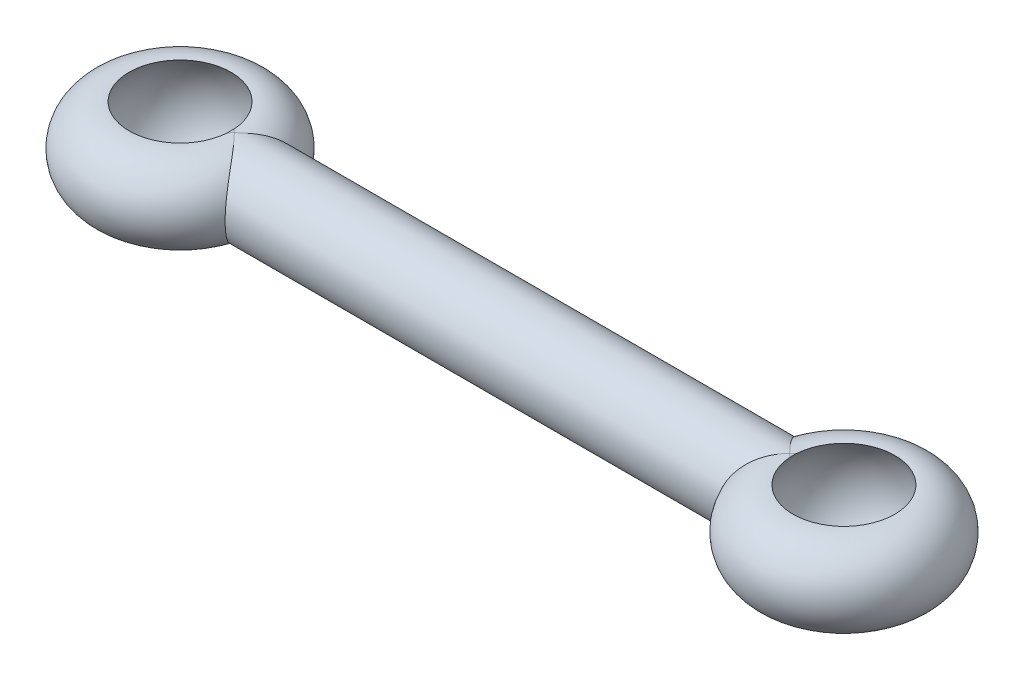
ISO-10303-21;
HEADER;
FILE_DESCRIPTION(('STEP AP214'),'2;1');
FILE_NAME('part.step','',(''),(''),'','','');
FILE_SCHEMA(('AUTOMOTIVE_DESIGN { 1 0 10303 214 1 1 1 1 }'));
ENDSEC;
DATA;
#1=APPLICATION_CONTEXT('core data for automotive mechanical design processes');
#2=APPLICATION_PROTOCOL_DEFINITION('international standard','automotive_design',2000,#1);
#3=PRODUCT_CONTEXT('',#1,'mechanical');
#4=PRODUCT('Part','Part','',(#3));
#5=PRODUCT_RELATED_PRODUCT_CATEGORY('part','',(#4));
#6=PRODUCT_DEFINITION_FORMATION('','',#4);
#7=PRODUCT_DEFINITION_CONTEXT('part definition',#1,'design');
#8=PRODUCT_DEFINITION('design','',#6,#7);
#9=PRODUCT_DEFINITION_SHAPE('','',#8);
#10=(LENGTH_UNIT() NAMED_UNIT(*) SI_UNIT(.MILLI.,.METRE.));
#11=(NAMED_UNIT(*) PLANE_ANGLE_UNIT() SI_UNIT($,.RADIAN.));
#12=(NAMED_UNIT(*) SI_UNIT($,.STERADIAN.) SOLID_ANGLE_UNIT());
#13=UNCERTAINTY_MEASURE_WITH_UNIT(LENGTH_MEASURE(1.E-05),#10,'distance_accuracy_value','');
#14=(GEOMETRIC_REPRESENTATION_CONTEXT(3) GLOBAL_UNCERTAINTY_ASSIGNED_CONTEXT((#13)) GLOBAL_UNIT_ASSIGNED_CONTEXT((#10,
#11,#12)) REPRESENTATION_CONTEXT('',''));
#15=CARTESIAN_POINT('',(0.,0.,0.));
#16=DIRECTION('',(0.,0.,1.));
#17=DIRECTION('',(1.,0.,0.));
#18=AXIS2_PLACEMENT_3D('',#15,#16,#17);
#19=CARTESIAN_POINT('',(0.,0.,0.));
#20=DIRECTION('',(-1.,0.,0.));
#21=DIRECTION('',(0.,0.,1.));
#22=AXIS2_PLACEMENT_3D('',#19,#20,#21);
#23=CYLINDRICAL_SURFACE('',#22,0.749999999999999);
#24=CARTESIAN_POINT('',(1.,0.750000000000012,0.));
#25=CARTESIAN_POINT('',(1.0012909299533,0.750000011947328,-0.00129092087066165));
#26=CARTESIAN_POINT('',(1.00258067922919,0.749996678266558,-0.00258317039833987));
#27=CARTESIAN_POINT('',(1.05229490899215,0.749738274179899,-0.0524900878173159));
#28=CARTESIAN_POINT('',(1.09904283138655,0.744735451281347,-0.102948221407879));
#29=CARTESIAN_POINT('',(1.18846651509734,0.723266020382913,-0.205226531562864));
#30=CARTESIAN_POINT('',(1.2311375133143,0.706786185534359,-0.257048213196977));
#31=CARTESIAN_POINT('',(1.30014078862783,0.667282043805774,-0.344763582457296));
#32=CARTESIAN_POINT('',(1.32771424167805,0.647357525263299,-0.38107468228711));
#33=CARTESIAN_POINT('',(1.37964821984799,0.600449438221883,-0.451378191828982));
#34=CARTESIAN_POINT('',(1.40401139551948,0.573471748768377,-0.485372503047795));
#35=CARTESIAN_POINT('',(1.44910416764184,0.512178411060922,-0.549694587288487));
#36=CARTESIAN_POINT('',(1.46979868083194,0.477798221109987,-0.57998617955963));
#37=CARTESIAN_POINT('',(1.50650588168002,0.402402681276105,-0.634611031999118));
#38=CARTESIAN_POINT('',(1.52252303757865,0.361393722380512,-0.658949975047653));
#39=CARTESIAN_POINT('',(1.54713224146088,0.280589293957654,-0.696744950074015));
#40=CARTESIAN_POINT('',(1.55647639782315,0.241529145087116,-0.711284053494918));
#41=CARTESIAN_POINT('',(1.57084552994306,0.160804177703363,-0.733751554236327));
#42=CARTESIAN_POINT('',(1.57587476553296,0.119141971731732,-0.741686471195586));
#43=CARTESIAN_POINT('',(1.58103957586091,0.0401544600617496,-0.749840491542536));
#44=CARTESIAN_POINT('',(1.58171498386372,0.00294939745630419,-0.750910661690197));
#45=CARTESIAN_POINT('',(1.57958279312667,-0.0711027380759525,-0.747540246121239));
#46=CARTESIAN_POINT('',(1.57677627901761,-0.107949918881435,-0.743101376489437));
#47=CARTESIAN_POINT('',(1.56794662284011,-0.178884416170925,-0.72921914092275));
#48=CARTESIAN_POINT('',(1.56204231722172,-0.213023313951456,-0.719960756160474));
#49=CARTESIAN_POINT('',(1.54728280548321,-0.279094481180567,-0.697014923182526));
#50=CARTESIAN_POINT('',(1.5384272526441,-0.311026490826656,-0.683326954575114));
#51=CARTESIAN_POINT('',(1.51752567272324,-0.373478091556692,-0.651385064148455));
#52=CARTESIAN_POINT('',(1.50534735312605,-0.403857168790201,-0.632944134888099));
#53=CARTESIAN_POINT('',(1.47834522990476,-0.460950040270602,-0.592661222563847));
#54=CARTESIAN_POINT('',(1.4635205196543,-0.487662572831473,-0.570818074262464));
#55=CARTESIAN_POINT('',(1.42972459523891,-0.539949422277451,-0.521897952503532));
#56=CARTESIAN_POINT('',(1.41047357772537,-0.565049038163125,-0.494508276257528));
#57=CARTESIAN_POINT('',(1.36949326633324,-0.610227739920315,-0.437545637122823));
#58=CARTESIAN_POINT('',(1.34776258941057,-0.630304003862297,-0.407971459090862));
#59=CARTESIAN_POINT('',(1.29842129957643,-0.668418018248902,-0.342597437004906));
#60=CARTESIAN_POINT('',(1.27043125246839,-0.685578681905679,-0.306573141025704));
#61=CARTESIAN_POINT('',(1.21204023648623,-0.713592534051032,-0.234093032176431));
#62=CARTESIAN_POINT('',(1.18163865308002,-0.724444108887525,-0.197637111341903));
#63=CARTESIAN_POINT('',(1.10356801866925,-0.744225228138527,-0.107849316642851));
#64=CARTESIAN_POINT('',(1.05462117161,-0.749725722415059,-0.0548256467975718));
#65=CARTESIAN_POINT('',(1.00258065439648,-0.749996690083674,-0.00258313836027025));
#66=CARTESIAN_POINT('',(1.0012909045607,-0.75000002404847,-0.00129088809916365));
#67=CARTESIAN_POINT('',(1.,-0.750000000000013,0.));
#68=B_SPLINE_CURVE_WITH_KNOTS('',3,(#24,#25,#26,#27,#28,#29,#30,#31,#32,#33,#34,#35,#36,#37,#38,
#39,#40,#41,#42,#43,#44,#45,#46,#47,#48,#49,#50,#51,#52,#53,#54,#55,#56,#57,#58,#59,#60,#61,#62,
#63,#64,#65,#66,#67),.UNSPECIFIED.,.F.,.F.,(4,2,2,2,2,2,2,2,2,2,2,2,2,2,2,2,2,2,2,2,2,4),(0.,
0.00547723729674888,0.211318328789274,0.417397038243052,0.566096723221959,0.714672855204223,
0.864601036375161,1.014385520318,1.14177482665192,1.2690382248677,1.38015835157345,
1.49124387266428,1.59834979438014,1.70546830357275,1.81770805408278,1.92998633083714,
2.05502993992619,2.18014363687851,2.32581656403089,2.47152673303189,2.68725182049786,
2.69272905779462),.UNSPECIFIED.);
#69=CARTESIAN_POINT('',(1.,0.750000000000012,0.));
#70=VERTEX_POINT('',#69);
#71=CARTESIAN_POINT('',(1.,-0.750000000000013,0.));
#72=VERTEX_POINT('',#71);
#73=EDGE_CURVE('E180',#70,#72,#68,.T.);
#74=ORIENTED_EDGE('',*,*,#73,.F.);
#75=CARTESIAN_POINT('',(1.,-0.750000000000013,0.));
#76=CARTESIAN_POINT('',(1.00129092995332,-0.750000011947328,0.00129092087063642));
#77=CARTESIAN_POINT('',(1.00258067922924,-0.749996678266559,0.00258317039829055));
#78=CARTESIAN_POINT('',(1.05229490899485,-0.749738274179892,0.0524900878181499));
#79=CARTESIAN_POINT('',(1.0990428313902,-0.744735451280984,0.102948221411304));
#80=CARTESIAN_POINT('',(1.18846651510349,-0.723266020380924,0.205226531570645));
#81=CARTESIAN_POINT('',(1.23113751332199,-0.706786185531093,0.257048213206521));
#82=CARTESIAN_POINT('',(1.30014078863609,-0.667282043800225,0.344763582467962));
#83=CARTESIAN_POINT('',(1.32771424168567,-0.647357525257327,0.381074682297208));
#84=CARTESIAN_POINT('',(1.37964821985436,-0.60044943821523,0.451378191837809));
#85=CARTESIAN_POINT('',(1.40401139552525,-0.573471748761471,0.48537250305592));
#86=CARTESIAN_POINT('',(1.44910416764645,-0.512178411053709,0.549694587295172));
#87=CARTESIAN_POINT('',(1.46979868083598,-0.47779822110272,0.579986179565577));
#88=CARTESIAN_POINT('',(1.506505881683,-0.402402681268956,0.634611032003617));
#89=CARTESIAN_POINT('',(1.52252303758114,-0.361393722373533,0.658949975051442));
#90=CARTESIAN_POINT('',(1.54713224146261,-0.280589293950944,0.696744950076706));
#91=CARTESIAN_POINT('',(1.55647639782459,-0.24152914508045,0.711284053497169));
#92=CARTESIAN_POINT('',(1.57084552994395,-0.160804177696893,0.733751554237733));
#93=CARTESIAN_POINT('',(1.57587476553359,-0.119141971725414,0.741686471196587));
#94=CARTESIAN_POINT('',(1.58103957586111,-0.040154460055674,0.749840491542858));
#95=CARTESIAN_POINT('',(1.58171498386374,-0.00294939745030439,0.750910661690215));
#96=CARTESIAN_POINT('',(1.57958279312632,0.0711027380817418,0.747540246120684));
#97=CARTESIAN_POINT('',(1.57677627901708,0.10794991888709,0.74310137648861));
#98=CARTESIAN_POINT('',(1.56794662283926,0.178884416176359,0.729219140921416));
#99=CARTESIAN_POINT('',(1.56204231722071,0.213023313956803,0.71996075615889));
#100=CARTESIAN_POINT('',(1.54728280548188,0.279094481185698,0.69701492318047));
#101=CARTESIAN_POINT('',(1.53842725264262,0.311026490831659,0.683326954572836));
#102=CARTESIAN_POINT('',(1.51752567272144,0.37347809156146,0.651385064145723));
#103=CARTESIAN_POINT('',(1.50534735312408,0.403857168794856,0.632944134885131));
#104=CARTESIAN_POINT('',(1.47834522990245,0.460950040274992,0.592661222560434));
#105=CARTESIAN_POINT('',(1.46352051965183,0.487662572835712,0.570818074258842));
#106=CARTESIAN_POINT('',(1.42972459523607,0.539949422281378,0.521897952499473));
#107=CARTESIAN_POINT('',(1.41047357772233,0.565049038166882,0.49450827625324));
#108=CARTESIAN_POINT('',(1.3694932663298,0.610227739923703,0.437545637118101));
#109=CARTESIAN_POINT('',(1.34776258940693,0.630304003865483,0.407971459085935));
#110=CARTESIAN_POINT('',(1.29842129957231,0.668418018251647,0.342597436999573));
#111=CARTESIAN_POINT('',(1.27043125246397,0.685578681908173,0.30657314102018));
#112=CARTESIAN_POINT('',(1.21204023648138,0.713592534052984,0.234093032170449));
#113=CARTESIAN_POINT('',(1.18163865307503,0.724444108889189,0.197637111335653));
#114=CARTESIAN_POINT('',(1.10356801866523,0.744225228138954,0.107849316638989));
#115=CARTESIAN_POINT('',(1.05462117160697,0.749725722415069,0.0548256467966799));
#116=CARTESIAN_POINT('',(1.00258065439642,0.749996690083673,0.00258313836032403));
#117=CARTESIAN_POINT('',(1.00129090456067,0.75000002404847,0.00129088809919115));
#118=CARTESIAN_POINT('',(1.,0.750000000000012,0.));
#119=B_SPLINE_CURVE_WITH_KNOTS('',3,(#75,#76,#77,#78,#79,#80,#81,#82,#83,#84,#85,#86,#87,#88,
#89,#90,#91,#92,#93,#94,#95,#96,#97,#98,#99,#100,#101,#102,#103,#104,#105,#106,#107,#108,#109,
#110,#111,#112,#113,#114,#115,#116,#117,#118),.UNSPECIFIED.,.F.,.F.,(4,2,2,2,2,2,2,2,2,2,2,2,2,
2,2,2,2,2,2,2,2,4),(0.,0.00547723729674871,0.211318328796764,0.41739703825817,0.566096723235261,
0.714672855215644,0.864601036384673,1.01438552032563,1.1417748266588,1.26903822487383,
1.38015835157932,1.49124387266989,1.59834979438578,1.70546830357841,1.81770805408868,
1.92998633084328,2.05502993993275,2.18014363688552,2.32581656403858,2.4715267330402,
2.68725182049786,2.69272905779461),.UNSPECIFIED.);
#120=EDGE_CURVE('E174',#72,#70,#119,.T.);
#121=ORIENTED_EDGE('',*,*,#120,.F.);
#122=EDGE_LOOP('',(#74,#121));
#123=FACE_BOUND('',#122,.T.);
#124=CARTESIAN_POINT('',(11.2417619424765,0.750000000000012,0.));
#125=CARTESIAN_POINT('',(11.2404710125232,0.750000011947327,0.00129092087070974));
#126=CARTESIAN_POINT('',(11.2391812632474,0.749996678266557,0.00258317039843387));
#127=CARTESIAN_POINT('',(11.1894670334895,0.749738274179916,0.0524900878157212));
#128=CARTESIAN_POINT('',(11.1427191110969,0.744735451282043,0.10294822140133));
#129=CARTESIAN_POINT('',(11.0532954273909,0.723266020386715,0.205226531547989));
#130=CARTESIAN_POINT('',(11.0106244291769,0.706786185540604,0.257048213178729));
#131=CARTESIAN_POINT('',(10.9416211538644,0.667282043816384,0.344763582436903));
#132=CARTESIAN_POINT('',(10.914047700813,0.647357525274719,0.381074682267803));
#133=CARTESIAN_POINT('',(10.8621137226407,0.600449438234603,0.451378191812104));
#134=CARTESIAN_POINT('',(10.837750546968,0.573471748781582,0.485372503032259));
#135=CARTESIAN_POINT('',(10.7926577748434,0.512178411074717,0.549694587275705));
#136=CARTESIAN_POINT('',(10.7719632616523,0.477798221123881,0.579986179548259));
#137=CARTESIAN_POINT('',(10.7352560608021,0.402402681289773,0.634611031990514));
#138=CARTESIAN_POINT('',(10.7192389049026,0.361393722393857,0.658949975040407));
#139=CARTESIAN_POINT('',(10.6946297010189,0.280589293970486,0.696744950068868));
#140=CARTESIAN_POINT('',(10.6852855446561,0.241529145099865,0.711284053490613));
#141=CARTESIAN_POINT('',(10.6709164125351,0.160804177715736,0.733751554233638));
#142=CARTESIAN_POINT('',(10.6658871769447,0.119141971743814,0.74168647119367));
#143=CARTESIAN_POINT('',(10.6607223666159,0.0401544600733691,0.749840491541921));
#144=CARTESIAN_POINT('',(10.6600469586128,0.00294939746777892,0.75091066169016));
#145=CARTESIAN_POINT('',(10.6621791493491,-0.0711027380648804,0.747540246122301));
#146=CARTESIAN_POINT('',(10.6649856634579,-0.107949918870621,0.743101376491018));
#147=CARTESIAN_POINT('',(10.6738153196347,-0.178884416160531,0.729219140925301));
#148=CARTESIAN_POINT('',(10.6797196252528,-0.213023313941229,0.719960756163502));
#149=CARTESIAN_POINT('',(10.6944791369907,-0.279094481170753,0.697014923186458));
#150=CARTESIAN_POINT('',(10.7033346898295,-0.311026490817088,0.683326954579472));
#151=CARTESIAN_POINT('',(10.7242362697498,-0.373478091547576,0.651385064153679));
#152=CARTESIAN_POINT('',(10.7364145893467,-0.403857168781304,0.632944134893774));
#153=CARTESIAN_POINT('',(10.7634167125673,-0.460950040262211,0.592661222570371));
#154=CARTESIAN_POINT('',(10.7782414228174,-0.487662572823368,0.570818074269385));
#155=CARTESIAN_POINT('',(10.8120373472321,-0.53994942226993,0.521897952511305));
#156=CARTESIAN_POINT('',(10.8312883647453,-0.565049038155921,0.494508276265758));
#157=CARTESIAN_POINT('',(10.8722686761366,-0.610227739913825,0.437545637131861));
#158=CARTESIAN_POINT('',(10.8939993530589,-0.630304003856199,0.407971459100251));
#159=CARTESIAN_POINT('',(10.9433406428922,-0.668418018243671,0.342597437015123));
#160=CARTESIAN_POINT('',(10.9713306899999,-0.685578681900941,0.306573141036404));
#161=CARTESIAN_POINT('',(11.0297217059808,-0.713592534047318,0.234093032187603));
#162=CARTESIAN_POINT('',(11.0601232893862,-0.724444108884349,0.197637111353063));
#163=CARTESIAN_POINT('',(11.1381939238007,-0.744225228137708,0.107849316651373));
#164=CARTESIAN_POINT('',(11.1871407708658,-0.749725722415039,0.0548256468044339));
#165=CARTESIAN_POINT('',(11.2391812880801,-0.749996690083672,0.00258313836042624));
#166=CARTESIAN_POINT('',(11.2404710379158,-0.750000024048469,0.0012908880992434));
#167=CARTESIAN_POINT('',(11.2417619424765,-0.750000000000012,0.));
#168=B_SPLINE_CURVE_WITH_KNOTS('',3,(#124,#125,#126,#127,#128,#129,#130,#131,#132,#133,#134,
#135,#136,#137,#138,#139,#140,#141,#142,#143,#144,#145,#146,#147,#148,#149,#150,#151,#152,#153,
#154,#155,#156,#157,#158,#159,#160,#161,#162,#163,#164,#165,#166,#167),.UNSPECIFIED.,.F.,.F.,(4,
2,2,2,2,2,2,2,2,2,2,2,2,2,2,2,2,2,2,2,2,4),(0.,0.00547723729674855,0.211318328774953,
0.417397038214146,0.566096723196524,0.714672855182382,0.864601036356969,1.01438552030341,
1.14177482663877,1.26903822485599,1.38015835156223,1.49124387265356,1.59834979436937,
1.70546830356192,1.8177080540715,1.92998633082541,2.05502993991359,2.1801436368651,
2.32581656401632,2.471526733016,2.68725182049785,2.6927290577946),.UNSPECIFIED.);
#169=CARTESIAN_POINT('',(11.2417619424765,0.750000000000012,0.));
#170=VERTEX_POINT('',#169);
#171=CARTESIAN_POINT('',(11.2417619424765,-0.750000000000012,0.));
#172=VERTEX_POINT('',#171);
#173=EDGE_CURVE('E57',#170,#172,#168,.T.);
#174=ORIENTED_EDGE('',*,*,#173,.F.);
#175=CARTESIAN_POINT('',(11.2417619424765,-0.750000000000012,0.));
#176=CARTESIAN_POINT('',(11.2404710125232,-0.750000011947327,-0.00129092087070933));
#177=CARTESIAN_POINT('',(11.2391812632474,-0.749996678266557,-0.00258317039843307));
#178=CARTESIAN_POINT('',(11.1894670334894,-0.749738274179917,-0.0524900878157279));
#179=CARTESIAN_POINT('',(11.1427191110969,-0.74473545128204,-0.102948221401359));
#180=CARTESIAN_POINT('',(11.0532954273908,-0.723266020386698,-0.205226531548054));
#181=CARTESIAN_POINT('',(11.0106244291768,-0.706786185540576,-0.257048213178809));
#182=CARTESIAN_POINT('',(10.9416211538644,-0.667282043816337,-0.344763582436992));
#183=CARTESIAN_POINT('',(10.9140477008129,-0.647357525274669,-0.381074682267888));
#184=CARTESIAN_POINT('',(10.8621137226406,-0.600449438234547,-0.451378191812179));
#185=CARTESIAN_POINT('',(10.837750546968,-0.573471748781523,-0.485372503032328));
#186=CARTESIAN_POINT('',(10.7926577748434,-0.512178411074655,-0.549694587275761));
#187=CARTESIAN_POINT('',(10.7719632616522,-0.477798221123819,-0.579986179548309));
#188=CARTESIAN_POINT('',(10.7352560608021,-0.402402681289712,-0.634611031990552));
#189=CARTESIAN_POINT('',(10.7192389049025,-0.361393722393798,-0.658949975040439));
#190=CARTESIAN_POINT('',(10.6946297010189,-0.280589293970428,-0.696744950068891));
#191=CARTESIAN_POINT('',(10.6852855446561,-0.241529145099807,-0.711284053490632));
#192=CARTESIAN_POINT('',(10.6709164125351,-0.16080417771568,-0.73375155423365));
#193=CARTESIAN_POINT('',(10.6658871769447,-0.119141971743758,-0.741686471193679));
#194=CARTESIAN_POINT('',(10.6607223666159,-0.0401544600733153,-0.749840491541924));
#195=CARTESIAN_POINT('',(10.6600469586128,-0.00294939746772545,-0.75091066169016));
#196=CARTESIAN_POINT('',(10.6621791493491,0.0711027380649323,-0.747540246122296));
#197=CARTESIAN_POINT('',(10.6649856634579,0.107949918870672,-0.74310137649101));
#198=CARTESIAN_POINT('',(10.6738153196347,0.17888441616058,-0.729219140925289));
#199=CARTESIAN_POINT('',(10.6797196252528,0.213023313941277,-0.719960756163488));
#200=CARTESIAN_POINT('',(10.6944791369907,0.279094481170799,-0.69701492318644));
#201=CARTESIAN_POINT('',(10.7033346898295,0.311026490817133,-0.683326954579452));
#202=CARTESIAN_POINT('',(10.7242362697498,0.373478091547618,-0.651385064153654));
#203=CARTESIAN_POINT('',(10.7364145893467,0.403857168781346,-0.632944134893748));
#204=CARTESIAN_POINT('',(10.7634167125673,0.460950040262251,-0.59266122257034));
#205=CARTESIAN_POINT('',(10.7782414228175,0.487662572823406,-0.570818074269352));
#206=CARTESIAN_POINT('',(10.8120373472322,0.539949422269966,-0.521897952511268));
#207=CARTESIAN_POINT('',(10.8312883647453,0.565049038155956,-0.494508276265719));
#208=CARTESIAN_POINT('',(10.8722686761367,0.610227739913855,-0.437545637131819));
#209=CARTESIAN_POINT('',(10.8939993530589,0.630304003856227,-0.407971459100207));
#210=CARTESIAN_POINT('',(10.9433406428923,0.668418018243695,-0.342597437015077));
#211=CARTESIAN_POINT('',(10.9713306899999,0.685578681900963,-0.306573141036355));
#212=CARTESIAN_POINT('',(11.0297217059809,0.713592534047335,-0.234093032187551));
#213=CARTESIAN_POINT('',(11.0601232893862,0.724444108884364,-0.197637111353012));
#214=CARTESIAN_POINT('',(11.1381939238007,0.744225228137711,-0.107849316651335));
#215=CARTESIAN_POINT('',(11.1871407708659,0.749725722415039,-0.0548256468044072));
#216=CARTESIAN_POINT('',(11.2391812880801,0.749996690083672,-0.00258313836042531));
#217=CARTESIAN_POINT('',(11.2404710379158,0.750000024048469,-0.00129088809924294));
#218=CARTESIAN_POINT('',(11.2417619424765,0.750000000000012,0.));
#219=B_SPLINE_CURVE_WITH_KNOTS('',3,(#175,#176,#177,#178,#179,#180,#181,#182,#183,#184,#185,
#186,#187,#188,#189,#190,#191,#192,#193,#194,#195,#196,#197,#198,#199,#200,#201,#202,#203,#204,
#205,#206,#207,#208,#209,#210,#211,#212,#213,#214,#215,#216,#217,#218),.UNSPECIFIED.,.F.,.F.,(4,
2,2,2,2,2,2,2,2,2,2,2,2,2,2,2,2,2,2,2,2,4),(0.,0.00547723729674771,0.211318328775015,
0.417397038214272,0.566096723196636,0.714672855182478,0.864601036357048,1.01438552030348,
1.14177482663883,1.26903822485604,1.38015835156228,1.49124387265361,1.59834979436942,
1.70546830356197,1.81770805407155,1.92998633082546,2.05502993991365,2.18014363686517,
2.32581656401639,2.47152673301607,2.68725182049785,2.6927290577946),.UNSPECIFIED.);
#220=EDGE_CURVE('E110',#172,#170,#219,.T.);
#221=ORIENTED_EDGE('',*,*,#220,.F.);
#222=EDGE_LOOP('',(#174,#221));
#223=FACE_BOUND('',#222,.T.);
#224=ADVANCED_FACE('F32',(#123,#223),#23,.T.);
#225=CARTESIAN_POINT('',(0.,0.,0.));
#226=DIRECTION('',(0.,-1.,0.));
#227=DIRECTION('',(0.,0.,-1.));
#228=AXIS2_PLACEMENT_3D('',#225,#226,#227);
#229=TOROIDAL_SURFACE('',#228,1.,0.75);
#230=CARTESIAN_POINT('',(1.,0.750000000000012,0.));
#231=CARTESIAN_POINT('',(0.998709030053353,0.750000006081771,-0.00129097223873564));
#232=CARTESIAN_POINT('',(0.997416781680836,0.7499966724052,-0.00258072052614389));
#233=CARTESIAN_POINT('',(0.967951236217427,0.749845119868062,-0.0319319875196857));
#234=CARTESIAN_POINT('',(0.939174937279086,0.748125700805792,-0.0594052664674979));
#235=CARTESIAN_POINT('',(0.880471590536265,0.741954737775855,-0.112816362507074));
#236=CARTESIAN_POINT('',(0.850543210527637,0.737499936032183,-0.138752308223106));
#237=CARTESIAN_POINT('',(0.789143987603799,0.726231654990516,-0.18910421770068));
#238=CARTESIAN_POINT('',(0.757657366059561,0.719385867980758,-0.21349365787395));
#239=CARTESIAN_POINT('',(0.693553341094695,0.7039203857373,-0.26000321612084));
#240=CARTESIAN_POINT('',(0.660938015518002,0.695303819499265,-0.282127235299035));
#241=CARTESIAN_POINT('',(0.627710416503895,0.686073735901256,-0.302989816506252));
#242=B_SPLINE_CURVE_WITH_KNOTS('',3,(#230,#231,#232,#233,#234,#235,#236,#237,#238,#239,#240,
#241),.UNSPECIFIED.,.F.,.F.,(4,2,2,2,2,4),(0.,0.00547723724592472,0.12476768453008,
0.244200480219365,0.365313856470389,0.486215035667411),.UNSPECIFIED.);
#243=CARTESIAN_POINT('',(0.936749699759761,0.747494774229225,-0.0612499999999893));
#244=VERTEX_POINT('',#243);
#245=EDGE_CURVE('E241',#244,#70,#242,.F.);
#246=ORIENTED_EDGE('',*,*,#245,.T.);
#247=ORIENTED_EDGE('',*,*,#73,.T.);
#248=CARTESIAN_POINT('',(1.,-0.750000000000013,0.));
#249=CARTESIAN_POINT('',(0.99870903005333,-0.750000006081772,-0.00129097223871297));
#250=CARTESIAN_POINT('',(0.997416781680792,-0.7499966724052,-0.00258072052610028));
#251=CARTESIAN_POINT('',(0.967951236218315,-0.749845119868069,-0.0319319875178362));
#252=CARTESIAN_POINT('',(0.939174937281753,-0.74812570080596,-0.059405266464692));
#253=CARTESIAN_POINT('',(0.880471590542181,-0.741954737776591,-0.112816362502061));
#254=CARTESIAN_POINT('',(0.85054321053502,-0.737499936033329,-0.138752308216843));
#255=CARTESIAN_POINT('',(0.789143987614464,-0.726231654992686,-0.189104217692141));
#256=CARTESIAN_POINT('',(0.757657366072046,-0.719385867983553,-0.213493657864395));
#257=CARTESIAN_POINT('',(0.693553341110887,-0.703920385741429,-0.260003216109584));
#258=CARTESIAN_POINT('',(0.660938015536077,-0.695303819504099,-0.282127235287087));
#259=CARTESIAN_POINT('',(0.627710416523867,-0.686073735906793,-0.302989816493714));
#260=B_SPLINE_CURVE_WITH_KNOTS('',3,(#248,#249,#250,#251,#252,#253,#254,#255,#256,#257,#258,
#259),.UNSPECIFIED.,.F.,.F.,(4,2,2,2,2,4),(0.,0.00547723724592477,0.124767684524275,
0.244200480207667,0.365313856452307,0.486215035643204),.UNSPECIFIED.);
#261=CARTESIAN_POINT('',(0.936749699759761,-0.747494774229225,-0.0612499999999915));
#262=VERTEX_POINT('',#261);
#263=EDGE_CURVE('E231',#72,#262,#260,.T.);
#264=ORIENTED_EDGE('',*,*,#263,.T.);
#265=CARTESIAN_POINT('',(0.,-0.747494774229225,0.));
#266=DIRECTION('',(0.,-1.,0.));
#267=DIRECTION('',(0.,0.,-1.));
#268=AXIS2_PLACEMENT_3D('',#265,#266,#267);
#269=CIRCLE('',#268,0.93875);
#270=CARTESIAN_POINT('',(0.936749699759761,-0.747494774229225,0.0612499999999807));
#271=VERTEX_POINT('',#270);
#272=EDGE_CURVE('E235',#271,#262,#269,.T.);
#273=ORIENTED_EDGE('',*,*,#272,.F.);
#274=CARTESIAN_POINT('',(1.,-0.750000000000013,0.));
#275=CARTESIAN_POINT('',(0.998709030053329,-0.750000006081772,0.00129097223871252));
#276=CARTESIAN_POINT('',(0.997416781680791,-0.7499966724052,0.00258072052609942));
#277=CARTESIAN_POINT('',(0.967951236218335,-0.749845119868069,0.0319319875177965));
#278=CARTESIAN_POINT('',(0.939174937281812,-0.748125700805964,0.0594052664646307));
#279=CARTESIAN_POINT('',(0.88047159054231,-0.741954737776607,0.112816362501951));
#280=CARTESIAN_POINT('',(0.850543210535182,-0.737499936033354,0.138752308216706));
#281=CARTESIAN_POINT('',(0.789143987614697,-0.726231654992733,0.189104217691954));
#282=CARTESIAN_POINT('',(0.757657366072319,-0.719385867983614,0.213493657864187));
#283=CARTESIAN_POINT('',(0.693553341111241,-0.703920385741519,0.260003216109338));
#284=CARTESIAN_POINT('',(0.660938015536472,-0.695303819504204,0.282127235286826));
#285=CARTESIAN_POINT('',(0.627710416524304,-0.686073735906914,0.302989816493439));
#286=B_SPLINE_CURVE_WITH_KNOTS('',3,(#274,#275,#276,#277,#278,#279,#280,#281,#282,#283,#284,
#285),.UNSPECIFIED.,.F.,.F.,(4,2,2,2,2,4),(0.,0.00547723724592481,0.124767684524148,
0.244200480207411,0.365313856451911,0.486215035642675),.UNSPECIFIED.);
#287=EDGE_CURVE('E228',#271,#72,#286,.F.);
#288=ORIENTED_EDGE('',*,*,#287,.T.);
#289=ORIENTED_EDGE('',*,*,#120,.T.);
#290=CARTESIAN_POINT('',(1.,0.750000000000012,0.));
#291=CARTESIAN_POINT('',(0.998709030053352,0.750000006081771,0.00129097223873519));
#292=CARTESIAN_POINT('',(0.997416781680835,0.7499966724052,0.00258072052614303));
#293=CARTESIAN_POINT('',(0.967951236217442,0.749845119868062,0.0319319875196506));
#294=CARTESIAN_POINT('',(0.939174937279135,0.748125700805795,0.0594052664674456));
#295=CARTESIAN_POINT('',(0.880471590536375,0.741954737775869,0.112816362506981));
#296=CARTESIAN_POINT('',(0.850543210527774,0.737499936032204,0.13875230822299));
#297=CARTESIAN_POINT('',(0.789143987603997,0.726231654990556,0.189104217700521));
#298=CARTESIAN_POINT('',(0.757657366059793,0.71938586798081,0.213493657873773));
#299=CARTESIAN_POINT('',(0.693553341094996,0.703920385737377,0.260003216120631));
#300=CARTESIAN_POINT('',(0.660938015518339,0.695303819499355,0.282127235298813));
#301=CARTESIAN_POINT('',(0.627710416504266,0.686073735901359,0.302989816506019));
#302=B_SPLINE_CURVE_WITH_KNOTS('',3,(#290,#291,#292,#293,#294,#295,#296,#297,#298,#299,#300,
#301),.UNSPECIFIED.,.F.,.F.,(4,2,2,2,2,4),(0.,0.00547723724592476,0.124767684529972,
0.244200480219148,0.365313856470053,0.486215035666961),.UNSPECIFIED.);
#303=CARTESIAN_POINT('',(0.936749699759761,0.747494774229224,0.0612499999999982));
#304=VERTEX_POINT('',#303);
#305=EDGE_CURVE('E253',#70,#304,#302,.T.);
#306=ORIENTED_EDGE('',*,*,#305,.T.);
#307=CARTESIAN_POINT('',(0.,0.747494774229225,0.));
#308=DIRECTION('',(0.,-1.,0.));
#309=DIRECTION('',(0.,0.,-1.));
#310=AXIS2_PLACEMENT_3D('',#307,#308,#309);
#311=CIRCLE('',#310,0.93875);
#312=EDGE_CURVE('E258',#304,#244,#311,.T.);
#313=ORIENTED_EDGE('',*,*,#312,.T.);
#314=EDGE_LOOP('',(#246,#247,#264,#273,#288,#289,#306,#313));
#315=FACE_BOUND('',#314,.T.);
#316=ADVANCED_FACE('F277',(#315),#229,.T.);
#317=CARTESIAN_POINT('',(0.,0.,0.));
#318=DIRECTION('',(0.,-1.,0.));
#319=DIRECTION('',(1.,0.,0.));
#320=AXIS2_PLACEMENT_3D('',#317,#318,#319);
#321=SPHERICAL_SURFACE('',#320,1.2);
#322=CARTESIAN_POINT('',(0.936749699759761,0.,0.));
#323=DIRECTION('',(1.,0.,0.));
#324=DIRECTION('',(0.,0.996659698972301,-0.0816666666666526));
#325=AXIS2_PLACEMENT_3D('',#322,#323,#324);
#326=CIRCLE('',#325,0.749999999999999);
#327=EDGE_CURVE('E232',#244,#304,#326,.T.);
#328=ORIENTED_EDGE('',*,*,#327,.F.);
#329=ORIENTED_EDGE('',*,*,#312,.F.);
#330=EDGE_LOOP('',(#328,#329));
#331=FACE_BOUND('',#330,.T.);
#332=ORIENTED_EDGE('',*,*,#272,.T.);
#333=CARTESIAN_POINT('',(0.936749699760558,-0.747494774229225,-0.061249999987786));
#334=CARTESIAN_POINT('',(0.937082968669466,-0.747494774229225,-0.0561530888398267));
#335=CARTESIAN_POINT('',(0.937374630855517,-0.747494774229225,-0.051053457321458));
#336=CARTESIAN_POINT('',(0.937874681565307,-0.747494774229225,-0.0408501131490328));
#337=CARTESIAN_POINT('',(0.938083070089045,-0.747494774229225,-0.0357464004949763));
#338=CARTESIAN_POINT('',(0.93841651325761,-0.747494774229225,-0.0255362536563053));
#339=CARTESIAN_POINT('',(0.938541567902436,-0.747494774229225,-0.020429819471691));
#340=CARTESIAN_POINT('',(0.938708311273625,-0.747494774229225,-0.0102155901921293));
#341=CARTESIAN_POINT('',(0.938749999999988,-0.747494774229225,-0.00510779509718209));
#342=CARTESIAN_POINT('',(0.938750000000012,-0.747494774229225,0.00510779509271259));
#343=CARTESIAN_POINT('',(0.938708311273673,-0.747494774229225,0.01021559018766));
#344=CARTESIAN_POINT('',(0.938541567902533,-0.747494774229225,0.0204298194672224));
#345=CARTESIAN_POINT('',(0.938416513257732,-0.747494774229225,0.0255362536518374));
#346=CARTESIAN_POINT('',(0.938083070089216,-0.747494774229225,0.0357464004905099));
#347=CARTESIAN_POINT('',(0.937874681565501,-0.747494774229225,0.0408501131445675));
#348=CARTESIAN_POINT('',(0.93737463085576,-0.747494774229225,0.0510534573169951));
#349=CARTESIAN_POINT('',(0.937082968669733,-0.747494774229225,0.0561530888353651));
#350=CARTESIAN_POINT('',(0.93674969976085,-0.747494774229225,0.061249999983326));
#351=B_SPLINE_CURVE_WITH_KNOTS('',3,(#333,#334,#335,#336,#337,#338,#339,#340,#341,#342,#343,
#344,#345,#346,#347,#348,#349,#350),.UNSPECIFIED.,.F.,.F.,(4,2,2,2,2,2,2,2,4),(0.,
0.0153232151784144,0.0306464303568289,0.045969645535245,0.0612928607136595,0.0766160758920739,
0.09193929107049,0.107262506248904,0.122585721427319),.UNSPECIFIED.);
#352=EDGE_CURVE('E238',#262,#271,#351,.T.);
#353=ORIENTED_EDGE('',*,*,#352,.T.);
#354=EDGE_LOOP('',(#332,#353));
#355=FACE_BOUND('',#354,.T.);
#356=ADVANCED_FACE('F34',(#331,#355),#321,.F.);
#357=ORIENTED_EDGE('',*,*,#263,.F.);
#358=ORIENTED_EDGE('',*,*,#287,.F.);
#359=ORIENTED_EDGE('',*,*,#352,.F.);
#360=EDGE_LOOP('',(#357,#358,#359));
#361=FACE_BOUND('',#360,.T.);
#362=ADVANCED_FACE('F138',(#361),#23,.T.);
#363=ORIENTED_EDGE('',*,*,#305,.F.);
#364=ORIENTED_EDGE('',*,*,#245,.F.);
#365=ORIENTED_EDGE('',*,*,#327,.T.);
#366=EDGE_LOOP('',(#363,#364,#365));
#367=FACE_BOUND('',#366,.T.);
#368=ADVANCED_FACE('F142',(#367),#23,.T.);
#369=CARTESIAN_POINT('',(12.2417619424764,0.,0.));
#370=DIRECTION('',(0.,1.,0.));
#371=DIRECTION('',(-1.,0.,0.));
#372=AXIS2_PLACEMENT_3D('',#369,#370,#371);
#373=TOROIDAL_SURFACE('',#372,0.999999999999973,0.749999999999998);
#374=ORIENTED_EDGE('',*,*,#220,.T.);
#375=CARTESIAN_POINT('',(11.2417619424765,0.750000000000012,0.));
#376=CARTESIAN_POINT('',(11.2430529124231,0.75000000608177,-0.00129097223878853));
#377=CARTESIAN_POINT('',(11.2443451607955,0.749996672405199,-0.00258072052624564));
#378=CARTESIAN_POINT('',(11.2738107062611,0.749845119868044,-0.0319319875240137));
#379=CARTESIAN_POINT('',(11.3025870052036,0.748125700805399,-0.0594052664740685));
#380=CARTESIAN_POINT('',(11.3612903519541,0.741954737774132,-0.112816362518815));
#381=CARTESIAN_POINT('',(11.3912187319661,0.7374999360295,-0.138752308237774));
#382=CARTESIAN_POINT('',(11.4526179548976,0.726231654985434,-0.189104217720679));
#383=CARTESIAN_POINT('',(11.4841045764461,0.719385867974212,-0.213493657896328));
#384=CARTESIAN_POINT('',(11.5482086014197,0.703920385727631,-0.260003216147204));
#385=CARTESIAN_POINT('',(11.5808239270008,0.695303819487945,-0.282127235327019));
#386=CARTESIAN_POINT('',(11.6140515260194,0.686073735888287,-0.302989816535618));
#387=B_SPLINE_CURVE_WITH_KNOTS('',3,(#375,#376,#377,#378,#379,#380,#381,#382,#383,#384,#385,
#386),.UNSPECIFIED.,.F.,.F.,(4,2,2,2,2,4),(0.,0.00547723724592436,0.124767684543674,
0.244200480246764,0.365313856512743,0.486215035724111),.UNSPECIFIED.);
#388=CARTESIAN_POINT('',(11.3050122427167,0.747494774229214,-0.061250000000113));
#389=VERTEX_POINT('',#388);
#390=EDGE_CURVE('E101',#170,#389,#387,.T.);
#391=ORIENTED_EDGE('',*,*,#390,.T.);
#392=CARTESIAN_POINT('',(12.2417619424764,0.747494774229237,0.));
#393=DIRECTION('',(0.,1.,0.));
#394=DIRECTION('',(-1.,0.,0.));
#395=AXIS2_PLACEMENT_3D('',#392,#393,#394);
#396=CIRCLE('',#395,0.938749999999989);
#397=CARTESIAN_POINT('',(11.3050122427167,0.747494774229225,0.0612500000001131));
#398=VERTEX_POINT('',#397);
#399=EDGE_CURVE('E93',#398,#389,#396,.T.);
#400=ORIENTED_EDGE('',*,*,#399,.F.);
#401=CARTESIAN_POINT('',(11.2417619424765,0.750000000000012,0.));
#402=CARTESIAN_POINT('',(11.2430529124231,0.75000000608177,0.00129097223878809));
#403=CARTESIAN_POINT('',(11.2443451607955,0.749996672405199,0.00258072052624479));
#404=CARTESIAN_POINT('',(11.2738107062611,0.749845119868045,0.0319319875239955));
#405=CARTESIAN_POINT('',(11.3025870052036,0.748125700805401,0.0594052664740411));
#406=CARTESIAN_POINT('',(11.361290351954,0.741954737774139,0.112816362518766));
#407=CARTESIAN_POINT('',(11.391218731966,0.737499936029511,0.138752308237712));
#408=CARTESIAN_POINT('',(11.4526179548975,0.726231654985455,0.189104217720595));
#409=CARTESIAN_POINT('',(11.484104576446,0.71938586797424,0.213493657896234));
#410=CARTESIAN_POINT('',(11.5482086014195,0.703920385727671,0.260003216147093));
#411=CARTESIAN_POINT('',(11.5808239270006,0.695303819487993,0.282127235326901));
#412=CARTESIAN_POINT('',(11.6140515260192,0.686073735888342,0.302989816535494));
#413=B_SPLINE_CURVE_WITH_KNOTS('',3,(#401,#402,#403,#404,#405,#406,#407,#408,#409,#410,#411,
#412),.UNSPECIFIED.,.F.,.F.,(4,2,2,2,2,4),(0.,0.00547723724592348,0.124767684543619,
0.24420048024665,0.365313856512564,0.486215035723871),.UNSPECIFIED.);
#414=EDGE_CURVE('E99',#398,#170,#413,.F.);
#415=ORIENTED_EDGE('',*,*,#414,.T.);
#416=ORIENTED_EDGE('',*,*,#173,.T.);
#417=CARTESIAN_POINT('',(11.2417619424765,-0.750000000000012,0.));
#418=CARTESIAN_POINT('',(11.2430529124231,-0.75000000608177,0.00129097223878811));
#419=CARTESIAN_POINT('',(11.2443451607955,-0.749996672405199,0.00258072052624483));
#420=CARTESIAN_POINT('',(11.2738107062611,-0.749845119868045,0.0319319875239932));
#421=CARTESIAN_POINT('',(11.3025870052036,-0.748125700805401,0.0594052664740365));
#422=CARTESIAN_POINT('',(11.361290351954,-0.74195473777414,0.112816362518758));
#423=CARTESIAN_POINT('',(11.391218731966,-0.737499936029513,0.138752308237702));
#424=CARTESIAN_POINT('',(11.4526179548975,-0.726231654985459,0.189104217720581));
#425=CARTESIAN_POINT('',(11.484104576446,-0.719385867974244,0.213493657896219));
#426=CARTESIAN_POINT('',(11.5482086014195,-0.703920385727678,0.260003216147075));
#427=CARTESIAN_POINT('',(11.5808239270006,-0.695303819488,0.282127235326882));
#428=CARTESIAN_POINT('',(11.6140515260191,-0.68607373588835,0.302989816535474));
#429=B_SPLINE_CURVE_WITH_KNOTS('',3,(#417,#418,#419,#420,#421,#422,#423,#424,#425,#426,#427,
#428),.UNSPECIFIED.,.F.,.F.,(4,2,2,2,2,4),(0.,0.00547723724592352,0.124767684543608,
0.244200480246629,0.365313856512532,0.486215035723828),.UNSPECIFIED.);
#430=CARTESIAN_POINT('',(11.3050122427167,-0.747494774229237,0.0612499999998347));
#431=VERTEX_POINT('',#430);
#432=EDGE_CURVE('E51',#172,#431,#429,.T.);
#433=ORIENTED_EDGE('',*,*,#432,.T.);
#434=CARTESIAN_POINT('',(12.2417619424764,-0.747494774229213,0.));
#435=DIRECTION('',(0.,1.,0.));
#436=DIRECTION('',(-1.,0.,0.));
#437=AXIS2_PLACEMENT_3D('',#434,#435,#436);
#438=CIRCLE('',#437,0.938750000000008);
#439=CARTESIAN_POINT('',(11.3050122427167,-0.747494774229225,-0.0612499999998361));
#440=VERTEX_POINT('',#439);
#441=EDGE_CURVE('E107',#431,#440,#438,.T.);
#442=ORIENTED_EDGE('',*,*,#441,.T.);
#443=CARTESIAN_POINT('',(11.2417619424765,-0.750000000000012,0.));
#444=CARTESIAN_POINT('',(11.2430529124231,-0.75000000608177,-0.00129097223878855));
#445=CARTESIAN_POINT('',(11.2443451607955,-0.749996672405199,-0.00258072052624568));
#446=CARTESIAN_POINT('',(11.2738107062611,-0.749845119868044,-0.0319319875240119));
#447=CARTESIAN_POINT('',(11.3025870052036,-0.7481257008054,-0.0594052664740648));
#448=CARTESIAN_POINT('',(11.361290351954,-0.741954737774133,-0.112816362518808));
#449=CARTESIAN_POINT('',(11.3912187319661,-0.737499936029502,-0.138752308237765));
#450=CARTESIAN_POINT('',(11.4526179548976,-0.726231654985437,-0.189104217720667));
#451=CARTESIAN_POINT('',(11.4841045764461,-0.719385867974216,-0.213493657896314));
#452=CARTESIAN_POINT('',(11.5482086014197,-0.703920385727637,-0.260003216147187));
#453=CARTESIAN_POINT('',(11.5808239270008,-0.695303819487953,-0.282127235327));
#454=CARTESIAN_POINT('',(11.6140515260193,-0.686073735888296,-0.302989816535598));
#455=B_SPLINE_CURVE_WITH_KNOTS('',3,(#443,#444,#445,#446,#447,#448,#449,#450,#451,#452,#453,
#454),.UNSPECIFIED.,.F.,.F.,(4,2,2,2,2,4),(0.,0.0054772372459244,0.124767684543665,
0.244200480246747,0.365313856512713,0.486215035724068),.UNSPECIFIED.);
#456=EDGE_CURVE('E106',#440,#172,#455,.F.);
#457=ORIENTED_EDGE('',*,*,#456,.T.);
#458=EDGE_LOOP('',(#374,#391,#400,#415,#416,#433,#442,#457));
#459=FACE_BOUND('',#458,.T.);
#460=ADVANCED_FACE('F105',(#459),#373,.T.);
#461=CARTESIAN_POINT('',(12.2417619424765,0.,0.));
#462=DIRECTION('',(-1.,0.,0.));
#463=DIRECTION('',(0.,0.,-1.));
#464=AXIS2_PLACEMENT_3D('',#461,#462,#463);
#465=SPHERICAL_SURFACE('',#464,1.2);
#466=CARTESIAN_POINT('',(11.3050122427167,0.,0.));
#467=DIRECTION('',(-1.,0.,0.));
#468=DIRECTION('',(0.,0.996659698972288,0.0816666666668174));
#469=AXIS2_PLACEMENT_3D('',#466,#467,#468);
#470=CIRCLE('',#469,0.749999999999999);
#471=EDGE_CURVE('E11',#398,#389,#470,.T.);
#472=ORIENTED_EDGE('',*,*,#471,.F.);
#473=ORIENTED_EDGE('',*,*,#399,.T.);
#474=EDGE_LOOP('',(#472,#473));
#475=FACE_BOUND('',#474,.T.);
#476=CARTESIAN_POINT('',(11.3050122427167,0.,0.));
#477=DIRECTION('',(-1.,0.,0.));
#478=DIRECTION('',(0.,-0.996659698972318,-0.0816666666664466));
#479=AXIS2_PLACEMENT_3D('',#476,#477,#478);
#480=CIRCLE('',#479,0.749999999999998);
#481=EDGE_CURVE('E44',#440,#431,#480,.T.);
#482=ORIENTED_EDGE('',*,*,#481,.F.);
#483=ORIENTED_EDGE('',*,*,#441,.F.);
#484=EDGE_LOOP('',(#482,#483));
#485=FACE_BOUND('',#484,.T.);
#486=ADVANCED_FACE('F90',(#475,#485),#465,.F.);
#487=ORIENTED_EDGE('',*,*,#432,.F.);
#488=ORIENTED_EDGE('',*,*,#456,.F.);
#489=ORIENTED_EDGE('',*,*,#481,.T.);
#490=EDGE_LOOP('',(#487,#488,#489));
#491=FACE_BOUND('',#490,.T.);
#492=ADVANCED_FACE('F283',(#491),#23,.T.);
#493=ORIENTED_EDGE('',*,*,#390,.F.);
#494=ORIENTED_EDGE('',*,*,#414,.F.);
#495=ORIENTED_EDGE('',*,*,#471,.T.);
#496=EDGE_LOOP('',(#493,#494,#495));
#497=FACE_BOUND('',#496,.T.);
#498=ADVANCED_FACE('F100',(#497),#23,.T.);
#499=CLOSED_SHELL('',(#224,#316,#356,#362,#368,#460,#486,#492,#498));
#500=MANIFOLD_SOLID_BREP('B2',#499);
#501=ADVANCED_BREP_SHAPE_REPRESENTATION('',(#18,#500),#14);
#502=SHAPE_DEFINITION_REPRESENTATION(#9,#501);
ENDSEC;
END-ISO-10303-21;
